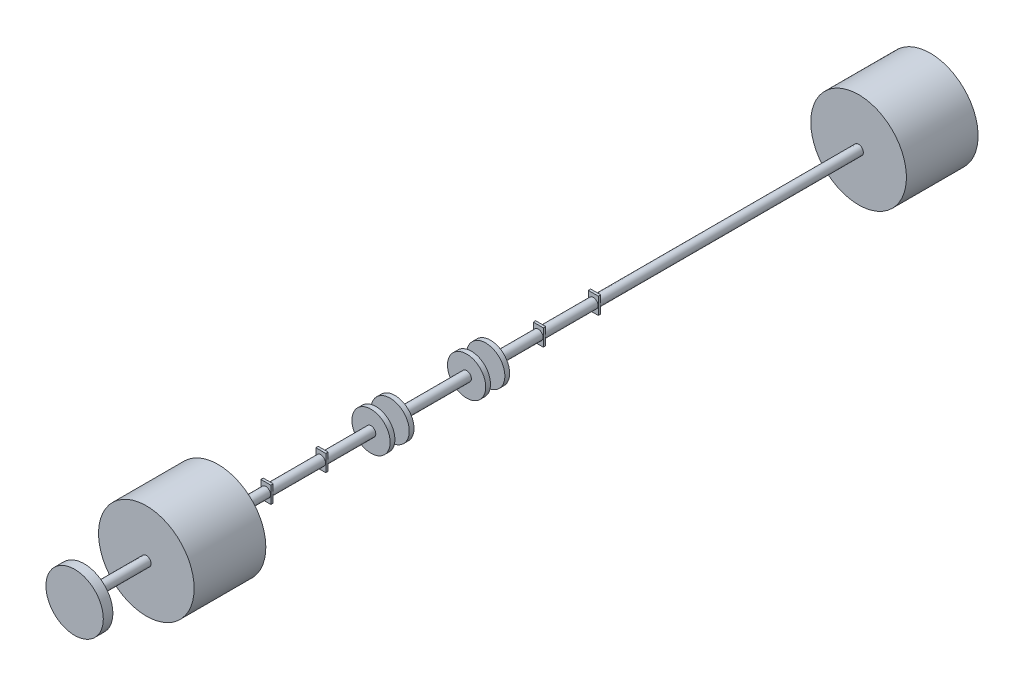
from build123d import *

# Parameters (mm, degrees)
ESQUISSE1_R                  = 10
EXTRUSION1_DEPTH             = 100
ESQUISSE2_W                  = 21
ESQUISSE2_H                  = 35
EXTRUSION2_DEPTH             = 5
EXTRUSION3_START             = 110
ESQUISSE3_R                  = 10
EXTRUSION3_DEPTH             = 110
ESQUISSE4_W                  = 21
ESQUISSE4_H                  = 35
EXTRUSION4_DEPTH             = 5
EXTRUSION5_START             = 100
ESQUISSE5_R                  = 10
EXTRUSION5_DEPTH             = 100
ESQUISSE12_R                 = 40
EXTRUSION10_DEPTH            = 10
EXTRUSION11_START            = 30
ESQUISSE13_R                 = 10
EXTRUSION11_DEPTH            = 30
ESQUISSE14_R                 = 40
EXTRUSION12_DEPTH            = 10
EXTRUSION13_START            = 150
ESQUISSE15_R                 = 10
EXTRUSION13_DEPTH            = 150
ESQUISSE16_R                 = 40
EXTRUSION14_DEPTH            = 10
EXTRUSION15_START            = 30
ESQUISSE17_R                 = 10
EXTRUSION15_DEPTH            = 30
ESQUISSE18_R                 = 40
EXTRUSION16_DEPTH            = 10
EXTRUSION17_START            = 100
ESQUISSE19_R                 = 10
EXTRUSION17_DEPTH            = 100
ESQUISSE20_W                 = 21
ESQUISSE20_H                 = 35
EXTRUSION18_DEPTH            = 5
EXTRUSION19_START            = 110
ESQUISSE21_R                 = 10
EXTRUSION19_DEPTH            = 110
ESQUISSE22_W                 = 21
ESQUISSE22_H                 = 35
EXTRUSION20_DEPTH            = 5
EXTRUSION21_START            = 550
ESQUISSE23_R                 = 10
EXTRUSION21_DEPTH            = 550
ENL_V_MAT_EXTRU_1_DEPTH      = 1242.289651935
ENL_V_MAT_EXTRU_1_DEPTH_BACK = 1242.289651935
ESQUISSE25_W                 = 80
ESQUISSE25_H                 = 30
ESQUISSE26_R                 = 100
EXTRUSION22_DEPTH            = 150
ESQUISSE27_R                 = 100
EXTRUSION23_DEPTH            = 150
ESQUISSE28_R                 = 10
EXTRUSION24_DEPTH            = 130
ESQUISSE29_R                 = 60
EXTRUSION25_DEPTH            = 20


with BuildPart() as part:
    # Esquisse1 → Extrusion1 (new body)
    with BuildSketch(Plane.XY):
        Circle(ESQUISSE1_R)
    extrude(amount=EXTRUSION1_DEPTH)

    # Esquisse2 → Extrusion2 (add)
    with BuildSketch(Plane(origin=(0, 0, 0), x_dir=(-1, 0, 0), z_dir=(0, 0, -1))):
        Rectangle(ESQUISSE2_W, ESQUISSE2_H)
    extrude(amount=EXTRUSION2_DEPTH)

    # Esquisse3 → Extrusion3 (add)
    with BuildSketch(Plane(origin=(0, 0, -5), x_dir=(-1, 0, 0), z_dir=(0, 0, -1)).offset(EXTRUSION3_START)):
        Circle(ESQUISSE3_R)
    extrude(amount=-EXTRUSION3_DEPTH)

    # Esquisse4 → Extrusion4 (add)
    with BuildSketch(Plane(origin=(0, 0, -115), x_dir=(-1, 0, 0), z_dir=(0, 0, -1))):
        Rectangle(ESQUISSE4_W, ESQUISSE4_H)
    extrude(amount=EXTRUSION4_DEPTH)

    # Esquisse5 → Extrusion5 (add)
    with BuildSketch(Plane(origin=(0, 0, -120), x_dir=(-1, 0, 0), z_dir=(0, 0, -1)).offset(EXTRUSION5_START)):
        Circle(ESQUISSE5_R)
    extrude(amount=-EXTRUSION5_DEPTH)

    # Esquisse12 → Extrusion10 (add)
    with BuildSketch(Plane(origin=(0, 0, -220), x_dir=(-1, 0, 0), z_dir=(0, 0, -1))):
        Circle(ESQUISSE12_R)
    extrude(amount=EXTRUSION10_DEPTH)

    # Esquisse13 → Extrusion11 (add)
    with BuildSketch(Plane(origin=(0, 0, -230), x_dir=(-1, 0, 0), z_dir=(0, 0, -1)).offset(EXTRUSION11_START)):
        Circle(ESQUISSE13_R)
    extrude(amount=-EXTRUSION11_DEPTH)

    # Esquisse14 → Extrusion12 (add)
    with BuildSketch(Plane(origin=(0, 0, -260), x_dir=(-1, 0, 0), z_dir=(0, 0, -1))):
        Circle(ESQUISSE14_R)
    extrude(amount=EXTRUSION12_DEPTH)

    # Esquisse15 → Extrusion13 (add)
    with BuildSketch(Plane(origin=(0, 0, -270), x_dir=(-1, 0, 0), z_dir=(0, 0, -1)).offset(EXTRUSION13_START)):
        Circle(ESQUISSE15_R)
    extrude(amount=-EXTRUSION13_DEPTH)

    # Esquisse16 → Extrusion14 (add)
    with BuildSketch(Plane(origin=(0, 0, -420), x_dir=(-1, 0, 0), z_dir=(0, 0, -1))):
        Circle(ESQUISSE16_R)
    extrude(amount=EXTRUSION14_DEPTH)

    # Esquisse17 → Extrusion15 (add)
    with BuildSketch(Plane(origin=(0, 0, -430), x_dir=(-1, 0, 0), z_dir=(0, 0, -1)).offset(EXTRUSION15_START)):
        Circle(ESQUISSE17_R)
    extrude(amount=-EXTRUSION15_DEPTH)

    # Esquisse18 → Extrusion16 (add)
    with BuildSketch(Plane(origin=(0, 0, -460), x_dir=(-1, 0, 0), z_dir=(0, 0, -1))):
        Circle(ESQUISSE18_R)
    extrude(amount=EXTRUSION16_DEPTH)

    # Esquisse19 → Extrusion17 (add)
    with BuildSketch(Plane(origin=(0, 0, -470), x_dir=(-1, 0, 0), z_dir=(0, 0, -1)).offset(EXTRUSION17_START)):
        Circle(ESQUISSE19_R)
    extrude(amount=-EXTRUSION17_DEPTH)

    # Esquisse20 → Extrusion18 (add)
    with BuildSketch(Plane(origin=(0, 0, -570), x_dir=(-1, 0, 0), z_dir=(0, 0, -1))):
        Rectangle(ESQUISSE20_W, ESQUISSE20_H)
    extrude(amount=EXTRUSION18_DEPTH)

    # Esquisse21 → Extrusion19 (add)
    with BuildSketch(Plane(origin=(0, 0, -575), x_dir=(-1, 0, 0), z_dir=(0, 0, -1)).offset(EXTRUSION19_START)):
        Circle(ESQUISSE21_R)
    extrude(amount=-EXTRUSION19_DEPTH)

    # Esquisse22 → Extrusion20 (add)
    with BuildSketch(Plane(origin=(0, 0, -685), x_dir=(-1, 0, 0), z_dir=(0, 0, -1))):
        Rectangle(ESQUISSE22_W, ESQUISSE22_H)
    extrude(amount=EXTRUSION20_DEPTH)

    # Esquisse23 → Extrusion21 (add)
    with BuildSketch(Plane(origin=(0, 0, -690), x_dir=(-1, 0, 0), z_dir=(0, 0, -1)).offset(EXTRUSION21_START)):
        Circle(ESQUISSE23_R)
    extrude(amount=-EXTRUSION21_DEPTH)

    # Esquisse25 → Enl_v. mat.-Extru.1 (cut, two sides: drawn at the far end of the back side and taken through both)
    with BuildSketch(Plane(origin=(0, 0, 0), x_dir=(1, 0, 0), z_dir=(0, 1, 0)).offset(-ENL_V_MAT_EXTRU_1_DEPTH_BACK)):
        with Locations((0, 445)):
            Rectangle(ESQUISSE25_W, ESQUISSE25_H)
        with Locations((0, 245)):
            Rectangle(ESQUISSE25_W, ESQUISSE25_H)
    extrude(amount=ENL_V_MAT_EXTRU_1_DEPTH + ENL_V_MAT_EXTRU_1_DEPTH_BACK, mode=Mode.SUBTRACT)


with BuildPart() as enl_v_mat_extru_1_piece_1:
    # of the separate pieces the step leaves, piece 1, a body of its own (enl_v_mat_extru_1_pieces)
    add(part.part.solids().sort_by_distance((-10.5, -17.5, -685))[0])

    # Esquisse27 → Extrusion23 (add)
    with BuildSketch(Plane(origin=(0, 0, -1240), x_dir=(-1, 0, 0), z_dir=(0, 0, -1))):
        with Locations(Location((0, 0, 0), (0, 0, 180))):
            Circle(ESQUISSE27_R)
    extrude(amount=EXTRUSION23_DEPTH)


with BuildPart() as enl_v_mat_extru_1_piece_2:
    # of the separate pieces the step leaves, piece 2, a body of its own (enl_v_mat_extru_1_pieces)
    add(part.part.solids().sort_by_distance((-40, 0, -230))[0])

    # Esquisse26 → Extrusion22 (add)
    with BuildSketch(Plane.XY.offset(100)):
        Circle(ESQUISSE26_R)
    extrude(amount=EXTRUSION22_DEPTH)

    # Esquisse28 → Extrusion24 (add)
    with BuildSketch(Plane.XY.offset(250)):
        with Locations(Location((0, 0, 0), (0, 0, 180))):
            Circle(ESQUISSE28_R)
    extrude(amount=EXTRUSION24_DEPTH)

    # Esquisse29 → Extrusion25 (add)
    with BuildSketch(Plane.XY.offset(380)):
        Circle(ESQUISSE29_R)
    extrude(amount=EXTRUSION25_DEPTH)


with BuildPart() as enl_v_mat_extru_1_piece_3:
    # of the separate pieces the step leaves, piece 3, a body of its own (enl_v_mat_extru_1_pieces)
    add(part.part.solids().sort_by_distance((-40, 0, -430))[0])


solid = Compound([enl_v_mat_extru_1_piece_1.part, enl_v_mat_extru_1_piece_2.part, enl_v_mat_extru_1_piece_3.part])
